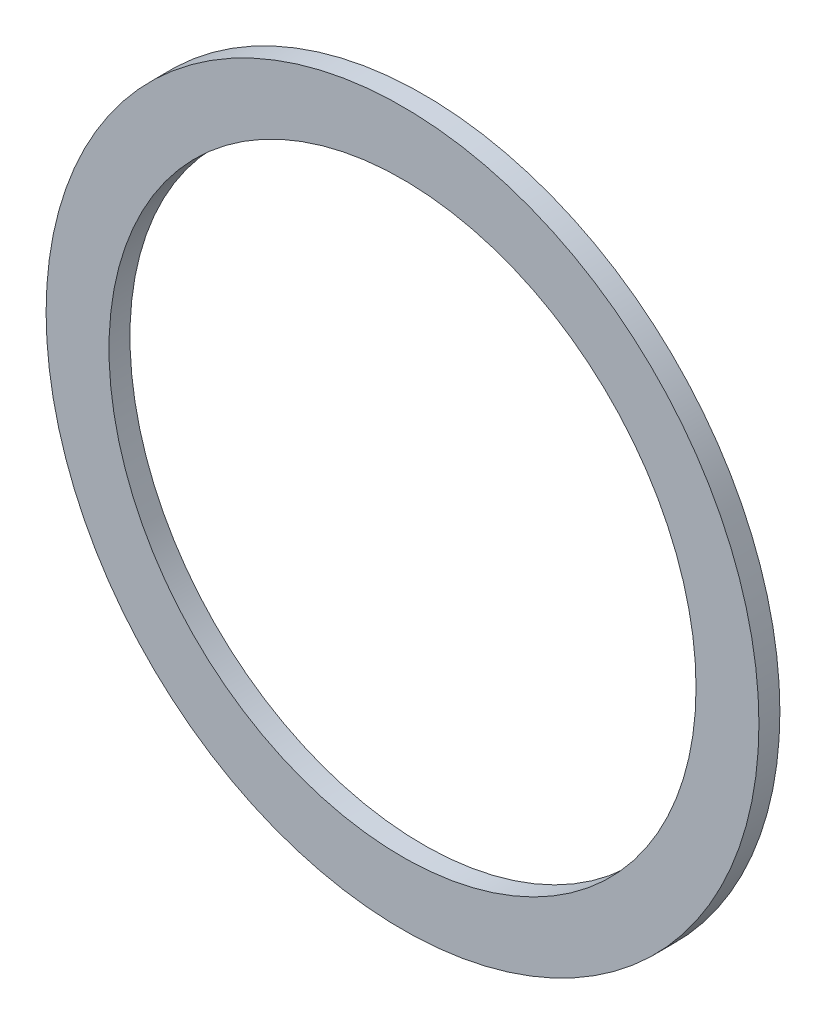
ISO-10303-21;
HEADER;
FILE_DESCRIPTION(('STEP AP214'),'2;1');
FILE_NAME('part.step','',(''),(''),'','','');
FILE_SCHEMA(('AUTOMOTIVE_DESIGN { 1 0 10303 214 1 1 1 1 }'));
ENDSEC;
DATA;
#1=APPLICATION_CONTEXT('core data for automotive mechanical design processes');
#2=APPLICATION_PROTOCOL_DEFINITION('international standard','automotive_design',2000,#1);
#3=PRODUCT_CONTEXT('',#1,'mechanical');
#4=PRODUCT('Part','Part','',(#3));
#5=PRODUCT_RELATED_PRODUCT_CATEGORY('part','',(#4));
#6=PRODUCT_DEFINITION_FORMATION('','',#4);
#7=PRODUCT_DEFINITION_CONTEXT('part definition',#1,'design');
#8=PRODUCT_DEFINITION('design','',#6,#7);
#9=PRODUCT_DEFINITION_SHAPE('','',#8);
#10=(LENGTH_UNIT() NAMED_UNIT(*) SI_UNIT(.MILLI.,.METRE.));
#11=(NAMED_UNIT(*) PLANE_ANGLE_UNIT() SI_UNIT($,.RADIAN.));
#12=(NAMED_UNIT(*) SI_UNIT($,.STERADIAN.) SOLID_ANGLE_UNIT());
#13=UNCERTAINTY_MEASURE_WITH_UNIT(LENGTH_MEASURE(1.E-05),#10,'distance_accuracy_value','');
#14=(GEOMETRIC_REPRESENTATION_CONTEXT(3) GLOBAL_UNCERTAINTY_ASSIGNED_CONTEXT((#13)) GLOBAL_UNIT_ASSIGNED_CONTEXT((#10,
#11,#12)) REPRESENTATION_CONTEXT('',''));
#15=CARTESIAN_POINT('',(0.,0.,0.));
#16=DIRECTION('',(0.,0.,1.));
#17=DIRECTION('',(1.,0.,0.));
#18=AXIS2_PLACEMENT_3D('',#15,#16,#17);
#19=CARTESIAN_POINT('',(0.,0.,1.5875));
#20=DIRECTION('',(0.,0.,1.));
#21=DIRECTION('',(1.,0.,0.));
#22=AXIS2_PLACEMENT_3D('',#19,#20,#21);
#23=PLANE('',#22);
#24=CARTESIAN_POINT('',(0.,0.,1.5875));
#25=DIRECTION('',(0.,0.,1.));
#26=DIRECTION('',(1.,0.,0.));
#27=AXIS2_PLACEMENT_3D('',#24,#25,#26);
#28=CIRCLE('',#27,26.9875);
#29=CARTESIAN_POINT('',(26.9875,0.,1.5875));
#30=VERTEX_POINT('',#29);
#31=EDGE_CURVE('E10',#30,#30,#28,.T.);
#32=ORIENTED_EDGE('',*,*,#31,.T.);
#33=EDGE_LOOP('',(#32));
#34=FACE_BOUND('',#33,.T.);
#35=CARTESIAN_POINT('',(0.,0.,1.5875));
#36=DIRECTION('',(0.,0.,1.));
#37=DIRECTION('',(1.,0.,0.));
#38=AXIS2_PLACEMENT_3D('',#35,#36,#37);
#39=CIRCLE('',#38,22.225);
#40=CARTESIAN_POINT('',(22.225,0.,1.5875));
#41=VERTEX_POINT('',#40);
#42=EDGE_CURVE('E40',#41,#41,#39,.T.);
#43=ORIENTED_EDGE('',*,*,#42,.F.);
#44=EDGE_LOOP('',(#43));
#45=FACE_BOUND('',#44,.T.);
#46=ADVANCED_FACE('F29',(#34,#45),#23,.T.);
#47=CARTESIAN_POINT('',(0.,0.,0.));
#48=DIRECTION('',(0.,0.,1.));
#49=DIRECTION('',(1.,0.,0.));
#50=AXIS2_PLACEMENT_3D('',#47,#48,#49);
#51=PLANE('',#50);
#52=CARTESIAN_POINT('',(0.,0.,0.));
#53=DIRECTION('',(0.,0.,1.));
#54=DIRECTION('',(1.,0.,0.));
#55=AXIS2_PLACEMENT_3D('',#52,#53,#54);
#56=CIRCLE('',#55,26.9875);
#57=CARTESIAN_POINT('',(26.9875,0.,0.));
#58=VERTEX_POINT('',#57);
#59=EDGE_CURVE('E36',#58,#58,#56,.T.);
#60=ORIENTED_EDGE('',*,*,#59,.F.);
#61=EDGE_LOOP('',(#60));
#62=FACE_BOUND('',#61,.T.);
#63=CARTESIAN_POINT('',(0.,0.,0.));
#64=DIRECTION('',(0.,0.,1.));
#65=DIRECTION('',(1.,0.,0.));
#66=AXIS2_PLACEMENT_3D('',#63,#64,#65);
#67=CIRCLE('',#66,22.225);
#68=CARTESIAN_POINT('',(22.225,0.,0.));
#69=VERTEX_POINT('',#68);
#70=EDGE_CURVE('E44',#69,#69,#67,.T.);
#71=ORIENTED_EDGE('',*,*,#70,.T.);
#72=EDGE_LOOP('',(#71));
#73=FACE_BOUND('',#72,.T.);
#74=ADVANCED_FACE('F50',(#62,#73),#51,.F.);
#75=CARTESIAN_POINT('',(0.,0.,1.5875));
#76=DIRECTION('',(0.,0.,-1.));
#77=DIRECTION('',(-1.,0.,0.));
#78=AXIS2_PLACEMENT_3D('',#75,#76,#77);
#79=CYLINDRICAL_SURFACE('',#78,26.9875);
#80=ORIENTED_EDGE('',*,*,#31,.F.);
#81=EDGE_LOOP('',(#80));
#82=FACE_BOUND('',#81,.T.);
#83=ORIENTED_EDGE('',*,*,#59,.T.);
#84=EDGE_LOOP('',(#83));
#85=FACE_BOUND('',#84,.T.);
#86=ADVANCED_FACE('F31',(#82,#85),#79,.T.);
#87=CARTESIAN_POINT('',(0.,0.,1.5875));
#88=DIRECTION('',(0.,0.,-1.));
#89=DIRECTION('',(-1.,0.,0.));
#90=AXIS2_PLACEMENT_3D('',#87,#88,#89);
#91=CYLINDRICAL_SURFACE('',#90,22.225);
#92=ORIENTED_EDGE('',*,*,#42,.T.);
#93=EDGE_LOOP('',(#92));
#94=FACE_BOUND('',#93,.T.);
#95=ORIENTED_EDGE('',*,*,#70,.F.);
#96=EDGE_LOOP('',(#95));
#97=FACE_BOUND('',#96,.T.);
#98=ADVANCED_FACE('F52',(#94,#97),#91,.F.);
#99=CLOSED_SHELL('',(#46,#74,#86,#98));
#100=MANIFOLD_SOLID_BREP('B2',#99);
#101=ADVANCED_BREP_SHAPE_REPRESENTATION('',(#18,#100),#14);
#102=SHAPE_DEFINITION_REPRESENTATION(#9,#101);
ENDSEC;
END-ISO-10303-21;
